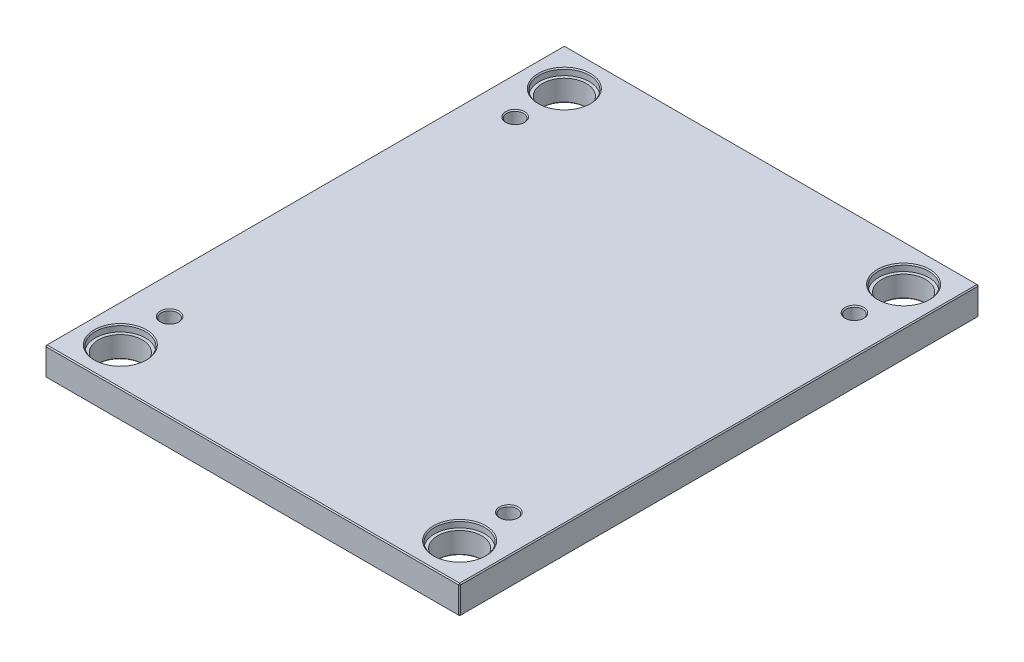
ISO-10303-21;
HEADER;
FILE_DESCRIPTION(('STEP AP214'),'2;1');
FILE_NAME('part.step','',(''),(''),'','','');
FILE_SCHEMA(('AUTOMOTIVE_DESIGN { 1 0 10303 214 1 1 1 1 }'));
ENDSEC;
DATA;
#1=APPLICATION_CONTEXT('core data for automotive mechanical design processes');
#2=APPLICATION_PROTOCOL_DEFINITION('international standard','automotive_design',2000,#1);
#3=PRODUCT_CONTEXT('',#1,'mechanical');
#4=PRODUCT('Part','Part','',(#3));
#5=PRODUCT_RELATED_PRODUCT_CATEGORY('part','',(#4));
#6=PRODUCT_DEFINITION_FORMATION('','',#4);
#7=PRODUCT_DEFINITION_CONTEXT('part definition',#1,'design');
#8=PRODUCT_DEFINITION('design','',#6,#7);
#9=PRODUCT_DEFINITION_SHAPE('','',#8);
#10=(LENGTH_UNIT() NAMED_UNIT(*) SI_UNIT(.MILLI.,.METRE.));
#11=(NAMED_UNIT(*) PLANE_ANGLE_UNIT() SI_UNIT($,.RADIAN.));
#12=(NAMED_UNIT(*) SI_UNIT($,.STERADIAN.) SOLID_ANGLE_UNIT());
#13=UNCERTAINTY_MEASURE_WITH_UNIT(LENGTH_MEASURE(1.E-05),#10,'distance_accuracy_value','');
#14=(GEOMETRIC_REPRESENTATION_CONTEXT(3) GLOBAL_UNCERTAINTY_ASSIGNED_CONTEXT((#13)) GLOBAL_UNIT_ASSIGNED_CONTEXT((#10,
#11,#12)) REPRESENTATION_CONTEXT('',''));
#15=CARTESIAN_POINT('',(0.,0.,0.));
#16=DIRECTION('',(0.,0.,1.));
#17=DIRECTION('',(1.,0.,0.));
#18=AXIS2_PLACEMENT_3D('',#15,#16,#17);
#19=CARTESIAN_POINT('',(-162.,0.,-212.));
#20=DIRECTION('',(0.,1.,0.));
#21=DIRECTION('',(0.,0.,1.));
#22=AXIS2_PLACEMENT_3D('',#19,#20,#21);
#23=CYLINDRICAL_SURFACE('',#22,21.);
#24=CARTESIAN_POINT('',(-162.,0.999999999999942,-212.));
#25=DIRECTION('',(0.,1.,0.));
#26=DIRECTION('',(0.,0.,1.));
#27=AXIS2_PLACEMENT_3D('',#24,#25,#26);
#28=CIRCLE('',#27,21.);
#29=CARTESIAN_POINT('',(-162.,0.999999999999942,-191.));
#30=VERTEX_POINT('',#29);
#31=EDGE_CURVE('E472',#30,#30,#28,.F.);
#32=ORIENTED_EDGE('',*,*,#31,.T.);
#33=EDGE_LOOP('',(#32));
#34=FACE_BOUND('',#33,.T.);
#35=CARTESIAN_POINT('',(-162.,20.7,-212.));
#36=DIRECTION('',(0.,1.,0.));
#37=DIRECTION('',(0.,0.,1.));
#38=AXIS2_PLACEMENT_3D('',#35,#36,#37);
#39=CIRCLE('',#38,21.);
#40=CARTESIAN_POINT('',(-162.,20.7,-191.));
#41=VERTEX_POINT('',#40);
#42=EDGE_CURVE('E221',#41,#41,#39,.F.);
#43=ORIENTED_EDGE('',*,*,#42,.F.);
#44=EDGE_LOOP('',(#43));
#45=FACE_BOUND('',#44,.T.);
#46=ADVANCED_FACE('F16',(#34,#45),#23,.F.);
#47=CARTESIAN_POINT('',(162.,0.,-212.));
#48=DIRECTION('',(0.,1.,0.));
#49=DIRECTION('',(0.,0.,1.));
#50=AXIS2_PLACEMENT_3D('',#47,#48,#49);
#51=CYLINDRICAL_SURFACE('',#50,21.);
#52=CARTESIAN_POINT('',(162.,0.999999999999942,-212.));
#53=DIRECTION('',(0.,1.,0.));
#54=DIRECTION('',(0.,0.,1.));
#55=AXIS2_PLACEMENT_3D('',#52,#53,#54);
#56=CIRCLE('',#55,21.);
#57=CARTESIAN_POINT('',(162.,0.999999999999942,-191.));
#58=VERTEX_POINT('',#57);
#59=EDGE_CURVE('E474',#58,#58,#56,.F.);
#60=ORIENTED_EDGE('',*,*,#59,.T.);
#61=EDGE_LOOP('',(#60));
#62=FACE_BOUND('',#61,.T.);
#63=CARTESIAN_POINT('',(162.,20.7,-212.));
#64=DIRECTION('',(0.,1.,0.));
#65=DIRECTION('',(0.,0.,1.));
#66=AXIS2_PLACEMENT_3D('',#63,#64,#65);
#67=CIRCLE('',#66,21.);
#68=CARTESIAN_POINT('',(162.,20.7,-191.));
#69=VERTEX_POINT('',#68);
#70=EDGE_CURVE('E218',#69,#69,#67,.F.);
#71=ORIENTED_EDGE('',*,*,#70,.F.);
#72=EDGE_LOOP('',(#71));
#73=FACE_BOUND('',#72,.T.);
#74=ADVANCED_FACE('F263',(#62,#73),#51,.F.);
#75=CARTESIAN_POINT('',(162.,0.,212.));
#76=DIRECTION('',(0.,1.,0.));
#77=DIRECTION('',(0.,0.,1.));
#78=AXIS2_PLACEMENT_3D('',#75,#76,#77);
#79=CYLINDRICAL_SURFACE('',#78,21.);
#80=CARTESIAN_POINT('',(162.,1.00000000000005,212.));
#81=DIRECTION('',(0.,1.,0.));
#82=DIRECTION('',(0.,0.,1.));
#83=AXIS2_PLACEMENT_3D('',#80,#81,#82);
#84=CIRCLE('',#83,21.);
#85=CARTESIAN_POINT('',(162.,1.00000000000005,233.));
#86=VERTEX_POINT('',#85);
#87=EDGE_CURVE('E477',#86,#86,#84,.F.);
#88=ORIENTED_EDGE('',*,*,#87,.T.);
#89=EDGE_LOOP('',(#88));
#90=FACE_BOUND('',#89,.T.);
#91=CARTESIAN_POINT('',(162.,20.7,212.));
#92=DIRECTION('',(0.,1.,0.));
#93=DIRECTION('',(0.,0.,1.));
#94=AXIS2_PLACEMENT_3D('',#91,#92,#93);
#95=CIRCLE('',#94,21.);
#96=CARTESIAN_POINT('',(162.,20.7,233.));
#97=VERTEX_POINT('',#96);
#98=EDGE_CURVE('E214',#97,#97,#95,.F.);
#99=ORIENTED_EDGE('',*,*,#98,.F.);
#100=EDGE_LOOP('',(#99));
#101=FACE_BOUND('',#100,.T.);
#102=ADVANCED_FACE('F270',(#90,#101),#79,.F.);
#103=CARTESIAN_POINT('',(-162.,0.,212.));
#104=DIRECTION('',(0.,1.,0.));
#105=DIRECTION('',(0.,0.,1.));
#106=AXIS2_PLACEMENT_3D('',#103,#104,#105);
#107=CYLINDRICAL_SURFACE('',#106,21.);
#108=CARTESIAN_POINT('',(-162.,0.999999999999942,212.));
#109=DIRECTION('',(0.,1.,0.));
#110=DIRECTION('',(0.,0.,1.));
#111=AXIS2_PLACEMENT_3D('',#108,#109,#110);
#112=CIRCLE('',#111,21.);
#113=CARTESIAN_POINT('',(-162.,0.999999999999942,233.));
#114=VERTEX_POINT('',#113);
#115=EDGE_CURVE('E480',#114,#114,#112,.F.);
#116=ORIENTED_EDGE('',*,*,#115,.T.);
#117=EDGE_LOOP('',(#116));
#118=FACE_BOUND('',#117,.T.);
#119=CARTESIAN_POINT('',(-162.,20.7,212.));
#120=DIRECTION('',(0.,1.,0.));
#121=DIRECTION('',(0.,0.,1.));
#122=AXIS2_PLACEMENT_3D('',#119,#120,#121);
#123=CIRCLE('',#122,21.);
#124=CARTESIAN_POINT('',(-162.,20.7,233.));
#125=VERTEX_POINT('',#124);
#126=EDGE_CURVE('E211',#125,#125,#123,.F.);
#127=ORIENTED_EDGE('',*,*,#126,.F.);
#128=EDGE_LOOP('',(#127));
#129=FACE_BOUND('',#128,.T.);
#130=ADVANCED_FACE('F277',(#118,#129),#107,.F.);
#131=CARTESIAN_POINT('',(-198.,27.,248.));
#132=DIRECTION('',(1.,0.,0.));
#133=DIRECTION('',(0.,0.,-1.));
#134=AXIS2_PLACEMENT_3D('',#131,#132,#133);
#135=PLANE('',#134);
#136=DIRECTION('',(0.,-1.,0.));
#137=VECTOR('',#136,1.);
#138=CARTESIAN_POINT('',(-198.,27.,-247.));
#139=LINE('',#138,#137);
#140=CARTESIAN_POINT('',(-198.,26.,-247.));
#141=VERTEX_POINT('',#140);
#142=CARTESIAN_POINT('',(-198.,1.00000000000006,-247.));
#143=VERTEX_POINT('',#142);
#144=EDGE_CURVE('E487',#141,#143,#139,.T.);
#145=ORIENTED_EDGE('',*,*,#144,.T.);
#146=DIRECTION('',(0.,0.,1.));
#147=VECTOR('',#146,1.);
#148=CARTESIAN_POINT('',(-198.,1.00000000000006,248.));
#149=LINE('',#148,#147);
#150=CARTESIAN_POINT('',(-198.,1.00000000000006,247.));
#151=VERTEX_POINT('',#150);
#152=EDGE_CURVE('E490',#143,#151,#149,.T.);
#153=ORIENTED_EDGE('',*,*,#152,.T.);
#154=DIRECTION('',(0.,1.,0.));
#155=VECTOR('',#154,1.);
#156=CARTESIAN_POINT('',(-198.,27.,247.));
#157=LINE('',#156,#155);
#158=CARTESIAN_POINT('',(-198.,26.,247.));
#159=VERTEX_POINT('',#158);
#160=EDGE_CURVE('E485',#151,#159,#157,.T.);
#161=ORIENTED_EDGE('',*,*,#160,.T.);
#162=DIRECTION('',(0.,0.,-1.));
#163=VECTOR('',#162,1.);
#164=CARTESIAN_POINT('',(-198.,26.,-248.));
#165=LINE('',#164,#163);
#166=EDGE_CURVE('E483',#159,#141,#165,.T.);
#167=ORIENTED_EDGE('',*,*,#166,.T.);
#168=EDGE_LOOP('',(#145,#153,#161,#167));
#169=FACE_BOUND('',#168,.T.);
#170=ADVANCED_FACE('F298',(#169),#135,.F.);
#171=CARTESIAN_POINT('',(198.,27.,248.));
#172=DIRECTION('',(0.,0.,-1.));
#173=DIRECTION('',(-1.,0.,0.));
#174=AXIS2_PLACEMENT_3D('',#171,#172,#173);
#175=PLANE('',#174);
#176=DIRECTION('',(-1.,0.,0.));
#177=VECTOR('',#176,1.);
#178=CARTESIAN_POINT('',(-198.,26.,248.));
#179=LINE('',#178,#177);
#180=CARTESIAN_POINT('',(197.,26.,248.));
#181=VERTEX_POINT('',#180);
#182=CARTESIAN_POINT('',(-197.,26.,248.));
#183=VERTEX_POINT('',#182);
#184=EDGE_CURVE('E509',#181,#183,#179,.T.);
#185=ORIENTED_EDGE('',*,*,#184,.T.);
#186=DIRECTION('',(0.,-1.,0.));
#187=VECTOR('',#186,1.);
#188=CARTESIAN_POINT('',(-197.,27.,248.));
#189=LINE('',#188,#187);
#190=CARTESIAN_POINT('',(-197.,1.00000000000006,248.));
#191=VERTEX_POINT('',#190);
#192=EDGE_CURVE('E515',#183,#191,#189,.T.);
#193=ORIENTED_EDGE('',*,*,#192,.T.);
#194=DIRECTION('',(1.,0.,0.));
#195=VECTOR('',#194,1.);
#196=CARTESIAN_POINT('',(198.,1.00000000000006,248.));
#197=LINE('',#196,#195);
#198=CARTESIAN_POINT('',(197.,1.00000000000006,248.));
#199=VERTEX_POINT('',#198);
#200=EDGE_CURVE('E513',#191,#199,#197,.T.);
#201=ORIENTED_EDGE('',*,*,#200,.T.);
#202=DIRECTION('',(0.,1.,0.));
#203=VECTOR('',#202,1.);
#204=CARTESIAN_POINT('',(197.,27.,248.));
#205=LINE('',#204,#203);
#206=EDGE_CURVE('E511',#199,#181,#205,.T.);
#207=ORIENTED_EDGE('',*,*,#206,.T.);
#208=EDGE_LOOP('',(#185,#193,#201,#207));
#209=FACE_BOUND('',#208,.T.);
#210=ADVANCED_FACE('F294',(#209),#175,.F.);
#211=CARTESIAN_POINT('',(198.,27.,248.));
#212=DIRECTION('',(-1.,0.,0.));
#213=DIRECTION('',(0.,0.,1.));
#214=AXIS2_PLACEMENT_3D('',#211,#212,#213);
#215=PLANE('',#214);
#216=DIRECTION('',(0.,0.,-1.));
#217=VECTOR('',#216,1.);
#218=CARTESIAN_POINT('',(198.,1.00000000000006,248.));
#219=LINE('',#218,#217);
#220=CARTESIAN_POINT('',(198.,1.00000000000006,247.));
#221=VERTEX_POINT('',#220);
#222=CARTESIAN_POINT('',(198.,1.00000000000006,-247.));
#223=VERTEX_POINT('',#222);
#224=EDGE_CURVE('E504',#221,#223,#219,.T.);
#225=ORIENTED_EDGE('',*,*,#224,.T.);
#226=DIRECTION('',(0.,1.,0.));
#227=VECTOR('',#226,1.);
#228=CARTESIAN_POINT('',(198.,27.,-247.));
#229=LINE('',#228,#227);
#230=CARTESIAN_POINT('',(198.,26.,-247.));
#231=VERTEX_POINT('',#230);
#232=EDGE_CURVE('E506',#223,#231,#229,.T.);
#233=ORIENTED_EDGE('',*,*,#232,.T.);
#234=DIRECTION('',(0.,0.,1.));
#235=VECTOR('',#234,1.);
#236=CARTESIAN_POINT('',(198.,26.,248.));
#237=LINE('',#236,#235);
#238=CARTESIAN_POINT('',(198.,26.,247.));
#239=VERTEX_POINT('',#238);
#240=EDGE_CURVE('E500',#231,#239,#237,.T.);
#241=ORIENTED_EDGE('',*,*,#240,.T.);
#242=DIRECTION('',(0.,-1.,0.));
#243=VECTOR('',#242,1.);
#244=CARTESIAN_POINT('',(198.,27.,247.));
#245=LINE('',#244,#243);
#246=EDGE_CURVE('E502',#239,#221,#245,.T.);
#247=ORIENTED_EDGE('',*,*,#246,.T.);
#248=EDGE_LOOP('',(#225,#233,#241,#247));
#249=FACE_BOUND('',#248,.T.);
#250=ADVANCED_FACE('F290',(#249),#215,.F.);
#251=CARTESIAN_POINT('',(198.,27.,-248.));
#252=DIRECTION('',(0.,0.,1.));
#253=DIRECTION('',(1.,0.,0.));
#254=AXIS2_PLACEMENT_3D('',#251,#252,#253);
#255=PLANE('',#254);
#256=DIRECTION('',(0.,-1.,0.));
#257=VECTOR('',#256,1.);
#258=CARTESIAN_POINT('',(197.,27.,-248.));
#259=LINE('',#258,#257);
#260=CARTESIAN_POINT('',(197.,26.,-248.));
#261=VERTEX_POINT('',#260);
#262=CARTESIAN_POINT('',(197.,1.00000000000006,-248.));
#263=VERTEX_POINT('',#262);
#264=EDGE_CURVE('E494',#261,#263,#259,.T.);
#265=ORIENTED_EDGE('',*,*,#264,.T.);
#266=DIRECTION('',(-1.,0.,0.));
#267=VECTOR('',#266,1.);
#268=CARTESIAN_POINT('',(198.,1.00000000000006,-248.));
#269=LINE('',#268,#267);
#270=CARTESIAN_POINT('',(-197.,1.00000000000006,-248.));
#271=VERTEX_POINT('',#270);
#272=EDGE_CURVE('E138',#263,#271,#269,.T.);
#273=ORIENTED_EDGE('',*,*,#272,.T.);
#274=DIRECTION('',(0.,1.,0.));
#275=VECTOR('',#274,1.);
#276=CARTESIAN_POINT('',(-197.,27.,-248.));
#277=LINE('',#276,#275);
#278=CARTESIAN_POINT('',(-197.,26.,-248.));
#279=VERTEX_POINT('',#278);
#280=EDGE_CURVE('E496',#271,#279,#277,.T.);
#281=ORIENTED_EDGE('',*,*,#280,.T.);
#282=DIRECTION('',(1.,0.,0.));
#283=VECTOR('',#282,1.);
#284=CARTESIAN_POINT('',(198.,26.,-248.));
#285=LINE('',#284,#283);
#286=EDGE_CURVE('E492',#279,#261,#285,.T.);
#287=ORIENTED_EDGE('',*,*,#286,.T.);
#288=EDGE_LOOP('',(#265,#273,#281,#287));
#289=FACE_BOUND('',#288,.T.);
#290=ADVANCED_FACE('F282',(#289),#255,.F.);
#291=CARTESIAN_POINT('',(0.,27.,0.));
#292=DIRECTION('',(0.,1.,0.));
#293=DIRECTION('',(0.,0.,1.));
#294=AXIS2_PLACEMENT_3D('',#291,#292,#293);
#295=PLANE('',#294);
#296=CARTESIAN_POINT('',(162.,27.,212.));
#297=DIRECTION('',(0.,1.,0.));
#298=DIRECTION('',(0.,0.,1.));
#299=AXIS2_PLACEMENT_3D('',#296,#297,#298);
#300=CIRCLE('',#299,25.);
#301=CARTESIAN_POINT('',(162.,27.,237.));
#302=VERTEX_POINT('',#301);
#303=EDGE_CURVE('E236',#302,#302,#300,.F.);
#304=ORIENTED_EDGE('',*,*,#303,.T.);
#305=EDGE_LOOP('',(#304));
#306=FACE_BOUND('',#305,.T.);
#307=CARTESIAN_POINT('',(-162.,27.,212.));
#308=DIRECTION('',(0.,1.,0.));
#309=DIRECTION('',(0.,0.,1.));
#310=AXIS2_PLACEMENT_3D('',#307,#308,#309);
#311=CIRCLE('',#310,25.);
#312=CARTESIAN_POINT('',(-162.,27.,237.));
#313=VERTEX_POINT('',#312);
#314=EDGE_CURVE('E233',#313,#313,#311,.F.);
#315=ORIENTED_EDGE('',*,*,#314,.T.);
#316=EDGE_LOOP('',(#315));
#317=FACE_BOUND('',#316,.T.);
#318=CARTESIAN_POINT('',(162.,27.,-212.));
#319=DIRECTION('',(0.,1.,0.));
#320=DIRECTION('',(0.,0.,1.));
#321=AXIS2_PLACEMENT_3D('',#318,#319,#320);
#322=CIRCLE('',#321,25.);
#323=CARTESIAN_POINT('',(162.,27.,-187.));
#324=VERTEX_POINT('',#323);
#325=EDGE_CURVE('E230',#324,#324,#322,.F.);
#326=ORIENTED_EDGE('',*,*,#325,.T.);
#327=EDGE_LOOP('',(#326));
#328=FACE_BOUND('',#327,.T.);
#329=CARTESIAN_POINT('',(-162.,27.,-212.));
#330=DIRECTION('',(0.,1.,0.));
#331=DIRECTION('',(0.,0.,1.));
#332=AXIS2_PLACEMENT_3D('',#329,#330,#331);
#333=CIRCLE('',#332,25.);
#334=CARTESIAN_POINT('',(-162.,27.,-187.));
#335=VERTEX_POINT('',#334);
#336=EDGE_CURVE('E227',#335,#335,#333,.F.);
#337=ORIENTED_EDGE('',*,*,#336,.T.);
#338=EDGE_LOOP('',(#337));
#339=FACE_BOUND('',#338,.T.);
#340=CARTESIAN_POINT('',(-162.,27.,165.));
#341=DIRECTION('',(0.,1.,0.));
#342=DIRECTION('',(0.,0.,1.));
#343=AXIS2_PLACEMENT_3D('',#340,#341,#342);
#344=CIRCLE('',#343,9.);
#345=CARTESIAN_POINT('',(-162.,27.,174.));
#346=VERTEX_POINT('',#345);
#347=EDGE_CURVE('E198',#346,#346,#344,.F.);
#348=ORIENTED_EDGE('',*,*,#347,.T.);
#349=EDGE_LOOP('',(#348));
#350=FACE_BOUND('',#349,.T.);
#351=CARTESIAN_POINT('',(162.,27.,165.));
#352=DIRECTION('',(0.,1.,0.));
#353=DIRECTION('',(0.,0.,1.));
#354=AXIS2_PLACEMENT_3D('',#351,#352,#353);
#355=CIRCLE('',#354,9.);
#356=CARTESIAN_POINT('',(162.,27.,174.));
#357=VERTEX_POINT('',#356);
#358=EDGE_CURVE('E195',#357,#357,#355,.F.);
#359=ORIENTED_EDGE('',*,*,#358,.T.);
#360=EDGE_LOOP('',(#359));
#361=FACE_BOUND('',#360,.T.);
#362=CARTESIAN_POINT('',(162.,27.,-165.));
#363=DIRECTION('',(0.,1.,0.));
#364=DIRECTION('',(0.,0.,1.));
#365=AXIS2_PLACEMENT_3D('',#362,#363,#364);
#366=CIRCLE('',#365,9.);
#367=CARTESIAN_POINT('',(162.,27.,-156.));
#368=VERTEX_POINT('',#367);
#369=EDGE_CURVE('E192',#368,#368,#366,.F.);
#370=ORIENTED_EDGE('',*,*,#369,.T.);
#371=EDGE_LOOP('',(#370));
#372=FACE_BOUND('',#371,.T.);
#373=CARTESIAN_POINT('',(-162.,27.,-165.));
#374=DIRECTION('',(0.,1.,0.));
#375=DIRECTION('',(0.,0.,1.));
#376=AXIS2_PLACEMENT_3D('',#373,#374,#375);
#377=CIRCLE('',#376,9.);
#378=CARTESIAN_POINT('',(-162.,27.,-156.));
#379=VERTEX_POINT('',#378);
#380=EDGE_CURVE('E188',#379,#379,#377,.F.);
#381=ORIENTED_EDGE('',*,*,#380,.T.);
#382=EDGE_LOOP('',(#381));
#383=FACE_BOUND('',#382,.T.);
#384=DIRECTION('',(0.,0.,-1.));
#385=VECTOR('',#384,1.);
#386=CARTESIAN_POINT('',(197.,27.,-248.));
#387=LINE('',#386,#385);
#388=CARTESIAN_POINT('',(197.,27.,247.));
#389=VERTEX_POINT('',#388);
#390=CARTESIAN_POINT('',(197.,27.,-247.));
#391=VERTEX_POINT('',#390);
#392=EDGE_CURVE('E31',#389,#391,#387,.T.);
#393=ORIENTED_EDGE('',*,*,#392,.T.);
#394=DIRECTION('',(-1.,0.,0.));
#395=VECTOR('',#394,1.);
#396=CARTESIAN_POINT('',(-198.,27.,-247.));
#397=LINE('',#396,#395);
#398=CARTESIAN_POINT('',(-197.,27.,-247.));
#399=VERTEX_POINT('',#398);
#400=EDGE_CURVE('E189',#391,#399,#397,.T.);
#401=ORIENTED_EDGE('',*,*,#400,.T.);
#402=DIRECTION('',(0.,0.,1.));
#403=VECTOR('',#402,1.);
#404=CARTESIAN_POINT('',(-197.,27.,248.));
#405=LINE('',#404,#403);
#406=CARTESIAN_POINT('',(-197.,27.,247.));
#407=VERTEX_POINT('',#406);
#408=EDGE_CURVE('E518',#399,#407,#405,.T.);
#409=ORIENTED_EDGE('',*,*,#408,.T.);
#410=DIRECTION('',(1.,0.,0.));
#411=VECTOR('',#410,1.);
#412=CARTESIAN_POINT('',(198.,27.,247.));
#413=LINE('',#412,#411);
#414=EDGE_CURVE('E36',#407,#389,#413,.T.);
#415=ORIENTED_EDGE('',*,*,#414,.T.);
#416=EDGE_LOOP('',(#393,#401,#409,#415));
#417=FACE_BOUND('',#416,.T.);
#418=ADVANCED_FACE('F279',(#306,#317,#328,#339,#350,#361,#372,#383,#417),#295,.T.);
#419=CARTESIAN_POINT('',(0.,0.,0.));
#420=DIRECTION('',(0.,1.,0.));
#421=DIRECTION('',(0.,0.,1.));
#422=AXIS2_PLACEMENT_3D('',#419,#420,#421);
#423=PLANE('',#422);
#424=CARTESIAN_POINT('',(-162.,0.,-212.));
#425=DIRECTION('',(0.,1.,0.));
#426=DIRECTION('',(0.,0.,1.));
#427=AXIS2_PLACEMENT_3D('',#424,#425,#426);
#428=CIRCLE('',#427,22.);
#429=CARTESIAN_POINT('',(-162.,0.,-190.));
#430=VERTEX_POINT('',#429);
#431=EDGE_CURVE('E469',#430,#430,#428,.T.);
#432=ORIENTED_EDGE('',*,*,#431,.T.);
#433=EDGE_LOOP('',(#432));
#434=FACE_BOUND('',#433,.T.);
#435=CARTESIAN_POINT('',(162.,0.,-212.));
#436=DIRECTION('',(0.,1.,0.));
#437=DIRECTION('',(0.,0.,1.));
#438=AXIS2_PLACEMENT_3D('',#435,#436,#437);
#439=CIRCLE('',#438,22.);
#440=CARTESIAN_POINT('',(162.,0.,-190.));
#441=VERTEX_POINT('',#440);
#442=EDGE_CURVE('E466',#441,#441,#439,.T.);
#443=ORIENTED_EDGE('',*,*,#442,.T.);
#444=EDGE_LOOP('',(#443));
#445=FACE_BOUND('',#444,.T.);
#446=CARTESIAN_POINT('',(162.,0.,212.));
#447=DIRECTION('',(0.,1.,0.));
#448=DIRECTION('',(0.,0.,1.));
#449=AXIS2_PLACEMENT_3D('',#446,#447,#448);
#450=CIRCLE('',#449,22.);
#451=CARTESIAN_POINT('',(162.,0.,234.));
#452=VERTEX_POINT('',#451);
#453=EDGE_CURVE('E463',#452,#452,#450,.T.);
#454=ORIENTED_EDGE('',*,*,#453,.T.);
#455=EDGE_LOOP('',(#454));
#456=FACE_BOUND('',#455,.T.);
#457=CARTESIAN_POINT('',(-162.,0.,212.));
#458=DIRECTION('',(0.,1.,0.));
#459=DIRECTION('',(0.,0.,1.));
#460=AXIS2_PLACEMENT_3D('',#457,#458,#459);
#461=CIRCLE('',#460,22.);
#462=CARTESIAN_POINT('',(-162.,0.,234.));
#463=VERTEX_POINT('',#462);
#464=EDGE_CURVE('E460',#463,#463,#461,.T.);
#465=ORIENTED_EDGE('',*,*,#464,.T.);
#466=EDGE_LOOP('',(#465));
#467=FACE_BOUND('',#466,.T.);
#468=DIRECTION('',(0.,0.,1.));
#469=VECTOR('',#468,1.);
#470=CARTESIAN_POINT('',(197.,0.,0.));
#471=LINE('',#470,#469);
#472=CARTESIAN_POINT('',(197.,0.,-247.));
#473=VERTEX_POINT('',#472);
#474=CARTESIAN_POINT('',(197.,0.,247.));
#475=VERTEX_POINT('',#474);
#476=EDGE_CURVE('E108',#473,#475,#471,.T.);
#477=ORIENTED_EDGE('',*,*,#476,.T.);
#478=DIRECTION('',(-1.,0.,0.));
#479=VECTOR('',#478,1.);
#480=CARTESIAN_POINT('',(0.,0.,247.));
#481=LINE('',#480,#479);
#482=CARTESIAN_POINT('',(-197.,0.,247.));
#483=VERTEX_POINT('',#482);
#484=EDGE_CURVE('E458',#475,#483,#481,.T.);
#485=ORIENTED_EDGE('',*,*,#484,.T.);
#486=DIRECTION('',(0.,0.,-1.));
#487=VECTOR('',#486,1.);
#488=CARTESIAN_POINT('',(-197.,0.,0.));
#489=LINE('',#488,#487);
#490=CARTESIAN_POINT('',(-197.,0.,-247.));
#491=VERTEX_POINT('',#490);
#492=EDGE_CURVE('E110',#483,#491,#489,.T.);
#493=ORIENTED_EDGE('',*,*,#492,.T.);
#494=DIRECTION('',(1.,0.,0.));
#495=VECTOR('',#494,1.);
#496=CARTESIAN_POINT('',(0.,0.,-247.));
#497=LINE('',#496,#495);
#498=EDGE_CURVE('E104',#491,#473,#497,.T.);
#499=ORIENTED_EDGE('',*,*,#498,.T.);
#500=EDGE_LOOP('',(#477,#485,#493,#499));
#501=FACE_BOUND('',#500,.T.);
#502=ADVANCED_FACE('F106',(#434,#445,#456,#467,#501),#423,.F.);
#503=CARTESIAN_POINT('',(-162.,0.,-212.));
#504=DIRECTION('',(0.,-1.,0.));
#505=DIRECTION('',(0.,0.,-1.));
#506=AXIS2_PLACEMENT_3D('',#503,#504,#505);
#507=CONICAL_SURFACE('',#506,22.,0.785398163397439);
#508=ORIENTED_EDGE('',*,*,#31,.F.);
#509=EDGE_LOOP('',(#508));
#510=FACE_BOUND('',#509,.T.);
#511=ORIENTED_EDGE('',*,*,#431,.F.);
#512=EDGE_LOOP('',(#511));
#513=FACE_BOUND('',#512,.T.);
#514=ADVANCED_FACE('F286',(#510,#513),#507,.F.);
#515=CARTESIAN_POINT('',(162.,0.,-212.));
#516=DIRECTION('',(0.,-1.,0.));
#517=DIRECTION('',(0.,0.,-1.));
#518=AXIS2_PLACEMENT_3D('',#515,#516,#517);
#519=CONICAL_SURFACE('',#518,22.,0.785398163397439);
#520=ORIENTED_EDGE('',*,*,#59,.F.);
#521=EDGE_LOOP('',(#520));
#522=FACE_BOUND('',#521,.T.);
#523=ORIENTED_EDGE('',*,*,#442,.F.);
#524=EDGE_LOOP('',(#523));
#525=FACE_BOUND('',#524,.T.);
#526=ADVANCED_FACE('F305',(#522,#525),#519,.F.);
#527=CARTESIAN_POINT('',(162.,0.,212.));
#528=DIRECTION('',(0.,-1.,0.));
#529=DIRECTION('',(0.,0.,-1.));
#530=AXIS2_PLACEMENT_3D('',#527,#528,#529);
#531=CONICAL_SURFACE('',#530,22.,0.785398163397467);
#532=ORIENTED_EDGE('',*,*,#87,.F.);
#533=EDGE_LOOP('',(#532));
#534=FACE_BOUND('',#533,.T.);
#535=ORIENTED_EDGE('',*,*,#453,.F.);
#536=EDGE_LOOP('',(#535));
#537=FACE_BOUND('',#536,.T.);
#538=ADVANCED_FACE('F309',(#534,#537),#531,.F.);
#539=CARTESIAN_POINT('',(-162.,0.,212.));
#540=DIRECTION('',(0.,-1.,0.));
#541=DIRECTION('',(0.,0.,-1.));
#542=AXIS2_PLACEMENT_3D('',#539,#540,#541);
#543=CONICAL_SURFACE('',#542,22.,0.785398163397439);
#544=ORIENTED_EDGE('',*,*,#115,.F.);
#545=EDGE_LOOP('',(#544));
#546=FACE_BOUND('',#545,.T.);
#547=ORIENTED_EDGE('',*,*,#464,.F.);
#548=EDGE_LOOP('',(#547));
#549=FACE_BOUND('',#548,.T.);
#550=ADVANCED_FACE('F313',(#546,#549),#543,.F.);
#551=CARTESIAN_POINT('',(198.,27.,247.));
#552=DIRECTION('',(-0.707106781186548,0.,-0.707106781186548));
#553=DIRECTION('',(0.,-1.,0.));
#554=AXIS2_PLACEMENT_3D('',#551,#552,#553);
#555=PLANE('',#554);
#556=DIRECTION('',(-0.707106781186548,0.,0.707106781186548));
#557=VECTOR('',#556,1.);
#558=CARTESIAN_POINT('',(197.,26.,248.));
#559=LINE('',#558,#557);
#560=EDGE_CURVE('E126',#181,#239,#559,.F.);
#561=ORIENTED_EDGE('',*,*,#560,.F.);
#562=ORIENTED_EDGE('',*,*,#206,.F.);
#563=DIRECTION('',(0.707106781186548,0.,-0.707106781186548));
#564=VECTOR('',#563,1.);
#565=CARTESIAN_POINT('',(197.,1.00000000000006,248.));
#566=LINE('',#565,#564);
#567=EDGE_CURVE('E180',#221,#199,#566,.F.);
#568=ORIENTED_EDGE('',*,*,#567,.F.);
#569=ORIENTED_EDGE('',*,*,#246,.F.);
#570=EDGE_LOOP('',(#561,#562,#568,#569));
#571=FACE_BOUND('',#570,.T.);
#572=ADVANCED_FACE('F317',(#571),#555,.F.);
#573=CARTESIAN_POINT('',(197.,26.,248.));
#574=DIRECTION('',(0.577350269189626,0.577350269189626,0.577350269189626));
#575=DIRECTION('',(0.707106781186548,0.,-0.707106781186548));
#576=AXIS2_PLACEMENT_3D('',#573,#574,#575);
#577=PLANE('',#576);
#578=DIRECTION('',(0.,-0.707106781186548,0.707106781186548));
#579=VECTOR('',#578,1.);
#580=CARTESIAN_POINT('',(197.,26.,248.));
#581=LINE('',#580,#579);
#582=EDGE_CURVE('E175',#181,#389,#581,.F.);
#583=ORIENTED_EDGE('',*,*,#582,.F.);
#584=ORIENTED_EDGE('',*,*,#560,.T.);
#585=DIRECTION('',(-0.707106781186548,0.707106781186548,0.));
#586=VECTOR('',#585,1.);
#587=CARTESIAN_POINT('',(197.5,26.5,247.));
#588=LINE('',#587,#586);
#589=EDGE_CURVE('E177',#389,#239,#588,.F.);
#590=ORIENTED_EDGE('',*,*,#589,.F.);
#591=EDGE_LOOP('',(#583,#584,#590));
#592=FACE_BOUND('',#591,.T.);
#593=ADVANCED_FACE('F385',(#592),#577,.T.);
#594=CARTESIAN_POINT('',(197.,1.00000000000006,248.));
#595=DIRECTION('',(0.577350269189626,-0.577350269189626,0.577350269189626));
#596=DIRECTION('',(0.707106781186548,0.,-0.707106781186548));
#597=AXIS2_PLACEMENT_3D('',#594,#595,#596);
#598=PLANE('',#597);
#599=DIRECTION('',(-0.707106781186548,-0.707106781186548,0.));
#600=VECTOR('',#599,1.);
#601=CARTESIAN_POINT('',(197.5,0.500000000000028,247.));
#602=LINE('',#601,#600);
#603=EDGE_CURVE('E124',#221,#475,#602,.T.);
#604=ORIENTED_EDGE('',*,*,#603,.F.);
#605=ORIENTED_EDGE('',*,*,#567,.T.);
#606=DIRECTION('',(0.,0.707106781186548,0.707106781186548));
#607=VECTOR('',#606,1.);
#608=CARTESIAN_POINT('',(197.,1.00000000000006,248.));
#609=LINE('',#608,#607);
#610=EDGE_CURVE('E172',#475,#199,#609,.T.);
#611=ORIENTED_EDGE('',*,*,#610,.F.);
#612=EDGE_LOOP('',(#604,#605,#611));
#613=FACE_BOUND('',#612,.T.);
#614=ADVANCED_FACE('F381',(#613),#598,.T.);
#615=CARTESIAN_POINT('',(197.,27.,0.));
#616=DIRECTION('',(0.707106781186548,0.707106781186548,0.));
#617=DIRECTION('',(0.,0.,1.));
#618=AXIS2_PLACEMENT_3D('',#615,#616,#617);
#619=PLANE('',#618);
#620=ORIENTED_EDGE('',*,*,#589,.T.);
#621=ORIENTED_EDGE('',*,*,#240,.F.);
#622=DIRECTION('',(0.707106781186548,-0.707106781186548,0.));
#623=VECTOR('',#622,1.);
#624=CARTESIAN_POINT('',(198.,26.,-247.));
#625=LINE('',#624,#623);
#626=EDGE_CURVE('E166',#391,#231,#625,.T.);
#627=ORIENTED_EDGE('',*,*,#626,.F.);
#628=ORIENTED_EDGE('',*,*,#392,.F.);
#629=EDGE_LOOP('',(#620,#621,#627,#628));
#630=FACE_BOUND('',#629,.T.);
#631=ADVANCED_FACE('F377',(#630),#619,.T.);
#632=CARTESIAN_POINT('',(0.,27.,247.));
#633=DIRECTION('',(0.,0.707106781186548,0.707106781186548));
#634=DIRECTION('',(-1.,0.,0.));
#635=AXIS2_PLACEMENT_3D('',#632,#633,#634);
#636=PLANE('',#635);
#637=ORIENTED_EDGE('',*,*,#582,.T.);
#638=ORIENTED_EDGE('',*,*,#414,.F.);
#639=DIRECTION('',(0.,0.707106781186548,-0.707106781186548));
#640=VECTOR('',#639,1.);
#641=CARTESIAN_POINT('',(-197.,26.5,247.5));
#642=LINE('',#641,#640);
#643=EDGE_CURVE('E163',#183,#407,#642,.T.);
#644=ORIENTED_EDGE('',*,*,#643,.F.);
#645=ORIENTED_EDGE('',*,*,#184,.F.);
#646=EDGE_LOOP('',(#637,#638,#644,#645));
#647=FACE_BOUND('',#646,.T.);
#648=ADVANCED_FACE('F373',(#647),#636,.T.);
#649=CARTESIAN_POINT('',(-197.,27.,248.));
#650=DIRECTION('',(0.707106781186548,0.,-0.707106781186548));
#651=DIRECTION('',(0.,-1.,0.));
#652=AXIS2_PLACEMENT_3D('',#649,#650,#651);
#653=PLANE('',#652);
#654=DIRECTION('',(0.707106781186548,0.,0.707106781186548));
#655=VECTOR('',#654,1.);
#656=CARTESIAN_POINT('',(-197.,1.00000000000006,248.));
#657=LINE('',#656,#655);
#658=EDGE_CURVE('E157',#191,#151,#657,.F.);
#659=ORIENTED_EDGE('',*,*,#658,.F.);
#660=ORIENTED_EDGE('',*,*,#192,.F.);
#661=DIRECTION('',(-0.707106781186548,0.,-0.707106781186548));
#662=VECTOR('',#661,1.);
#663=CARTESIAN_POINT('',(-198.,26.,247.));
#664=LINE('',#663,#662);
#665=EDGE_CURVE('E160',#159,#183,#664,.F.);
#666=ORIENTED_EDGE('',*,*,#665,.F.);
#667=ORIENTED_EDGE('',*,*,#160,.F.);
#668=EDGE_LOOP('',(#659,#660,#666,#667));
#669=FACE_BOUND('',#668,.T.);
#670=ADVANCED_FACE('F369',(#669),#653,.F.);
#671=CARTESIAN_POINT('',(198.,1.00000000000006,248.));
#672=DIRECTION('',(0.,0.707106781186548,-0.707106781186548));
#673=DIRECTION('',(1.,0.,0.));
#674=AXIS2_PLACEMENT_3D('',#671,#672,#673);
#675=PLANE('',#674);
#676=ORIENTED_EDGE('',*,*,#610,.T.);
#677=ORIENTED_EDGE('',*,*,#200,.F.);
#678=DIRECTION('',(0.,-0.707106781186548,-0.707106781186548));
#679=VECTOR('',#678,1.);
#680=CARTESIAN_POINT('',(-197.,1.00000000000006,248.));
#681=LINE('',#680,#679);
#682=EDGE_CURVE('E135',#483,#191,#681,.F.);
#683=ORIENTED_EDGE('',*,*,#682,.F.);
#684=ORIENTED_EDGE('',*,*,#484,.F.);
#685=EDGE_LOOP('',(#676,#677,#683,#684));
#686=FACE_BOUND('',#685,.T.);
#687=ADVANCED_FACE('F366',(#686),#675,.F.);
#688=CARTESIAN_POINT('',(198.,1.00000000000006,248.));
#689=DIRECTION('',(-0.707106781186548,0.707106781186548,0.));
#690=DIRECTION('',(0.,0.,-1.));
#691=AXIS2_PLACEMENT_3D('',#688,#689,#690);
#692=PLANE('',#691);
#693=ORIENTED_EDGE('',*,*,#603,.T.);
#694=ORIENTED_EDGE('',*,*,#476,.F.);
#695=DIRECTION('',(0.707106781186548,0.707106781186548,0.));
#696=VECTOR('',#695,1.);
#697=CARTESIAN_POINT('',(197.5,0.500000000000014,-247.));
#698=LINE('',#697,#696);
#699=EDGE_CURVE('E121',#223,#473,#698,.F.);
#700=ORIENTED_EDGE('',*,*,#699,.F.);
#701=ORIENTED_EDGE('',*,*,#224,.F.);
#702=EDGE_LOOP('',(#693,#694,#700,#701));
#703=FACE_BOUND('',#702,.T.);
#704=ADVANCED_FACE('F119',(#703),#692,.F.);
#705=CARTESIAN_POINT('',(197.,27.,-248.));
#706=DIRECTION('',(-0.707106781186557,0.,0.707106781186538));
#707=DIRECTION('',(0.,-1.,0.));
#708=AXIS2_PLACEMENT_3D('',#705,#706,#707);
#709=PLANE('',#708);
#710=DIRECTION('',(0.707106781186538,0.,0.707106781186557));
#711=VECTOR('',#710,1.);
#712=CARTESIAN_POINT('',(198.,26.,-247.));
#713=LINE('',#712,#711);
#714=EDGE_CURVE('E168',#231,#261,#713,.F.);
#715=ORIENTED_EDGE('',*,*,#714,.F.);
#716=ORIENTED_EDGE('',*,*,#232,.F.);
#717=DIRECTION('',(-0.707106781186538,0.,-0.707106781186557));
#718=VECTOR('',#717,1.);
#719=CARTESIAN_POINT('',(197.,1.00000000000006,-248.));
#720=LINE('',#719,#718);
#721=EDGE_CURVE('E134',#263,#223,#720,.F.);
#722=ORIENTED_EDGE('',*,*,#721,.F.);
#723=ORIENTED_EDGE('',*,*,#264,.F.);
#724=EDGE_LOOP('',(#715,#716,#722,#723));
#725=FACE_BOUND('',#724,.T.);
#726=ADVANCED_FACE('F359',(#725),#709,.F.);
#727=CARTESIAN_POINT('',(198.,26.,-247.));
#728=DIRECTION('',(0.577350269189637,0.57735026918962,-0.57735026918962));
#729=DIRECTION('',(-0.707106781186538,0.,-0.707106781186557));
#730=AXIS2_PLACEMENT_3D('',#727,#728,#729);
#731=PLANE('',#730);
#732=ORIENTED_EDGE('',*,*,#626,.T.);
#733=ORIENTED_EDGE('',*,*,#714,.T.);
#734=DIRECTION('',(0.,0.707106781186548,0.707106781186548));
#735=VECTOR('',#734,1.);
#736=CARTESIAN_POINT('',(197.,26.5,-247.5));
#737=LINE('',#736,#735);
#738=EDGE_CURVE('E152',#391,#261,#737,.F.);
#739=ORIENTED_EDGE('',*,*,#738,.F.);
#740=EDGE_LOOP('',(#732,#733,#739));
#741=FACE_BOUND('',#740,.T.);
#742=ADVANCED_FACE('F355',(#741),#731,.T.);
#743=CARTESIAN_POINT('',(-198.,26.,247.));
#744=DIRECTION('',(-0.577350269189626,0.577350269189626,0.577350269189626));
#745=DIRECTION('',(0.707106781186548,0.,0.707106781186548));
#746=AXIS2_PLACEMENT_3D('',#743,#744,#745);
#747=PLANE('',#746);
#748=ORIENTED_EDGE('',*,*,#665,.T.);
#749=ORIENTED_EDGE('',*,*,#643,.T.);
#750=DIRECTION('',(-0.707106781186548,-0.707106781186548,0.));
#751=VECTOR('',#750,1.);
#752=CARTESIAN_POINT('',(-198.,26.,247.));
#753=LINE('',#752,#751);
#754=EDGE_CURVE('E143',#159,#407,#753,.F.);
#755=ORIENTED_EDGE('',*,*,#754,.F.);
#756=EDGE_LOOP('',(#748,#749,#755));
#757=FACE_BOUND('',#756,.T.);
#758=ADVANCED_FACE('F351',(#757),#747,.T.);
#759=CARTESIAN_POINT('',(-197.,1.00000000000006,248.));
#760=DIRECTION('',(-0.577350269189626,-0.577350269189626,0.577350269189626));
#761=DIRECTION('',(0.707106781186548,0.,0.707106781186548));
#762=AXIS2_PLACEMENT_3D('',#759,#760,#761);
#763=PLANE('',#762);
#764=ORIENTED_EDGE('',*,*,#682,.T.);
#765=ORIENTED_EDGE('',*,*,#658,.T.);
#766=DIRECTION('',(-0.707106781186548,0.707106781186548,0.));
#767=VECTOR('',#766,1.);
#768=CARTESIAN_POINT('',(-197.5,0.500000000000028,247.));
#769=LINE('',#768,#767);
#770=EDGE_CURVE('E139',#483,#151,#769,.T.);
#771=ORIENTED_EDGE('',*,*,#770,.F.);
#772=EDGE_LOOP('',(#764,#765,#771));
#773=FACE_BOUND('',#772,.T.);
#774=ADVANCED_FACE('F348',(#773),#763,.T.);
#775=CARTESIAN_POINT('',(197.,1.00000000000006,-248.));
#776=DIRECTION('',(0.577350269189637,-0.57735026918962,-0.57735026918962));
#777=DIRECTION('',(-0.707106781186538,0.,-0.707106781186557));
#778=AXIS2_PLACEMENT_3D('',#775,#776,#777);
#779=PLANE('',#778);
#780=ORIENTED_EDGE('',*,*,#721,.T.);
#781=ORIENTED_EDGE('',*,*,#699,.T.);
#782=DIRECTION('',(0.,-0.707106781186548,0.707106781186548));
#783=VECTOR('',#782,1.);
#784=CARTESIAN_POINT('',(197.,1.00000000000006,-248.));
#785=LINE('',#784,#783);
#786=EDGE_CURVE('E131',#263,#473,#785,.T.);
#787=ORIENTED_EDGE('',*,*,#786,.F.);
#788=EDGE_LOOP('',(#780,#781,#787));
#789=FACE_BOUND('',#788,.T.);
#790=ADVANCED_FACE('F130',(#789),#779,.T.);
#791=CARTESIAN_POINT('',(0.,27.,-247.));
#792=DIRECTION('',(0.,0.707106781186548,-0.707106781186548));
#793=DIRECTION('',(1.,0.,0.));
#794=AXIS2_PLACEMENT_3D('',#791,#792,#793);
#795=PLANE('',#794);
#796=ORIENTED_EDGE('',*,*,#738,.T.);
#797=ORIENTED_EDGE('',*,*,#286,.F.);
#798=DIRECTION('',(0.,-0.707106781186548,-0.707106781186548));
#799=VECTOR('',#798,1.);
#800=CARTESIAN_POINT('',(-197.,26.,-248.));
#801=LINE('',#800,#799);
#802=EDGE_CURVE('E140',#399,#279,#801,.T.);
#803=ORIENTED_EDGE('',*,*,#802,.F.);
#804=ORIENTED_EDGE('',*,*,#400,.F.);
#805=EDGE_LOOP('',(#796,#797,#803,#804));
#806=FACE_BOUND('',#805,.T.);
#807=ADVANCED_FACE('F341',(#806),#795,.T.);
#808=CARTESIAN_POINT('',(-197.,27.,0.));
#809=DIRECTION('',(-0.707106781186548,0.707106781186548,0.));
#810=DIRECTION('',(0.,0.,-1.));
#811=AXIS2_PLACEMENT_3D('',#808,#809,#810);
#812=PLANE('',#811);
#813=ORIENTED_EDGE('',*,*,#754,.T.);
#814=ORIENTED_EDGE('',*,*,#408,.F.);
#815=DIRECTION('',(0.707106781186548,0.707106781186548,0.));
#816=VECTOR('',#815,1.);
#817=CARTESIAN_POINT('',(-197.5,26.5,-247.));
#818=LINE('',#817,#816);
#819=EDGE_CURVE('E146',#141,#399,#818,.T.);
#820=ORIENTED_EDGE('',*,*,#819,.F.);
#821=ORIENTED_EDGE('',*,*,#166,.F.);
#822=EDGE_LOOP('',(#813,#814,#820,#821));
#823=FACE_BOUND('',#822,.T.);
#824=ADVANCED_FACE('F337',(#823),#812,.T.);
#825=CARTESIAN_POINT('',(-198.,1.00000000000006,248.));
#826=DIRECTION('',(0.707106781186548,0.707106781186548,0.));
#827=DIRECTION('',(0.,0.,1.));
#828=AXIS2_PLACEMENT_3D('',#825,#826,#827);
#829=PLANE('',#828);
#830=ORIENTED_EDGE('',*,*,#770,.T.);
#831=ORIENTED_EDGE('',*,*,#152,.F.);
#832=DIRECTION('',(0.707106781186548,-0.707106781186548,0.));
#833=VECTOR('',#832,1.);
#834=CARTESIAN_POINT('',(-198.,1.00000000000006,-247.));
#835=LINE('',#834,#833);
#836=EDGE_CURVE('E529',#491,#143,#835,.F.);
#837=ORIENTED_EDGE('',*,*,#836,.F.);
#838=ORIENTED_EDGE('',*,*,#492,.F.);
#839=EDGE_LOOP('',(#830,#831,#837,#838));
#840=FACE_BOUND('',#839,.T.);
#841=ADVANCED_FACE('F334',(#840),#829,.F.);
#842=CARTESIAN_POINT('',(198.,1.00000000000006,-248.));
#843=DIRECTION('',(0.,0.707106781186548,0.707106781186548));
#844=DIRECTION('',(-1.,0.,0.));
#845=AXIS2_PLACEMENT_3D('',#842,#843,#844);
#846=PLANE('',#845);
#847=ORIENTED_EDGE('',*,*,#786,.T.);
#848=ORIENTED_EDGE('',*,*,#498,.F.);
#849=DIRECTION('',(0.,0.707106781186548,-0.707106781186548));
#850=VECTOR('',#849,1.);
#851=CARTESIAN_POINT('',(-197.,0.500000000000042,-247.5));
#852=LINE('',#851,#850);
#853=EDGE_CURVE('E526',#271,#491,#852,.F.);
#854=ORIENTED_EDGE('',*,*,#853,.F.);
#855=ORIENTED_EDGE('',*,*,#272,.F.);
#856=EDGE_LOOP('',(#847,#848,#854,#855));
#857=FACE_BOUND('',#856,.T.);
#858=ADVANCED_FACE('F137',(#857),#846,.F.);
#859=CARTESIAN_POINT('',(-197.,26.,-248.));
#860=DIRECTION('',(-0.577350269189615,0.577350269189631,-0.577350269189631));
#861=DIRECTION('',(0.,0.707106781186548,0.707106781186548));
#862=AXIS2_PLACEMENT_3D('',#859,#860,#861);
#863=PLANE('',#862);
#864=ORIENTED_EDGE('',*,*,#819,.T.);
#865=ORIENTED_EDGE('',*,*,#802,.T.);
#866=DIRECTION('',(0.707106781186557,0.,-0.707106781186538));
#867=VECTOR('',#866,1.);
#868=CARTESIAN_POINT('',(-197.,26.,-248.));
#869=LINE('',#868,#867);
#870=EDGE_CURVE('E524',#141,#279,#869,.T.);
#871=ORIENTED_EDGE('',*,*,#870,.F.);
#872=EDGE_LOOP('',(#864,#865,#871));
#873=FACE_BOUND('',#872,.T.);
#874=ADVANCED_FACE('F327',(#873),#863,.T.);
#875=CARTESIAN_POINT('',(-198.,1.00000000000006,-247.));
#876=DIRECTION('',(-0.577350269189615,-0.577350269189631,-0.577350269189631));
#877=DIRECTION('',(0.,0.707106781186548,-0.707106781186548));
#878=AXIS2_PLACEMENT_3D('',#875,#876,#877);
#879=PLANE('',#878);
#880=ORIENTED_EDGE('',*,*,#853,.T.);
#881=ORIENTED_EDGE('',*,*,#836,.T.);
#882=DIRECTION('',(-0.707106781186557,0.,0.707106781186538));
#883=VECTOR('',#882,1.);
#884=CARTESIAN_POINT('',(-198.,1.00000000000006,-247.));
#885=LINE('',#884,#883);
#886=EDGE_CURVE('E455',#271,#143,#885,.T.);
#887=ORIENTED_EDGE('',*,*,#886,.F.);
#888=EDGE_LOOP('',(#880,#881,#887));
#889=FACE_BOUND('',#888,.T.);
#890=ADVANCED_FACE('F323',(#889),#879,.T.);
#891=CARTESIAN_POINT('',(-198.,27.,-247.));
#892=DIRECTION('',(0.707106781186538,0.,0.707106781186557));
#893=DIRECTION('',(0.,-1.,0.));
#894=AXIS2_PLACEMENT_3D('',#891,#892,#893);
#895=PLANE('',#894);
#896=ORIENTED_EDGE('',*,*,#870,.T.);
#897=ORIENTED_EDGE('',*,*,#280,.F.);
#898=ORIENTED_EDGE('',*,*,#886,.T.);
#899=ORIENTED_EDGE('',*,*,#144,.F.);
#900=EDGE_LOOP('',(#896,#897,#898,#899));
#901=FACE_BOUND('',#900,.T.);
#902=ADVANCED_FACE('F319',(#901),#895,.F.);
#903=CARTESIAN_POINT('',(-162.,5.,-165.));
#904=DIRECTION('',(0.,1.,0.));
#905=DIRECTION('',(0.,0.,1.));
#906=AXIS2_PLACEMENT_3D('',#903,#904,#905);
#907=CYLINDRICAL_SURFACE('',#906,8.);
#908=CARTESIAN_POINT('',(-162.,26.,-165.));
#909=DIRECTION('',(0.,1.,0.));
#910=DIRECTION('',(0.,0.,1.));
#911=AXIS2_PLACEMENT_3D('',#908,#909,#910);
#912=CIRCLE('',#911,8.);
#913=CARTESIAN_POINT('',(-162.,26.,-157.));
#914=VERTEX_POINT('',#913);
#915=EDGE_CURVE('E207',#914,#914,#912,.T.);
#916=ORIENTED_EDGE('',*,*,#915,.T.);
#917=EDGE_LOOP('',(#916));
#918=FACE_BOUND('',#917,.T.);
#919=CARTESIAN_POINT('',(-162.,5.,-165.));
#920=DIRECTION('',(0.,1.,0.));
#921=DIRECTION('',(0.,0.,1.));
#922=AXIS2_PLACEMENT_3D('',#919,#920,#921);
#923=CIRCLE('',#922,8.);
#924=CARTESIAN_POINT('',(-162.,5.,-157.));
#925=VERTEX_POINT('',#924);
#926=EDGE_CURVE('E448',#925,#925,#923,.T.);
#927=ORIENTED_EDGE('',*,*,#926,.F.);
#928=EDGE_LOOP('',(#927));
#929=FACE_BOUND('',#928,.T.);
#930=ADVANCED_FACE('F322',(#918,#929),#907,.F.);
#931=CARTESIAN_POINT('',(-162.,5.,-165.));
#932=DIRECTION('',(0.,1.,0.));
#933=DIRECTION('',(0.,0.,1.));
#934=AXIS2_PLACEMENT_3D('',#931,#932,#933);
#935=PLANE('',#934);
#936=ORIENTED_EDGE('',*,*,#926,.T.);
#937=EDGE_LOOP('',(#936));
#938=FACE_BOUND('',#937,.T.);
#939=ADVANCED_FACE('F596',(#938),#935,.T.);
#940=CARTESIAN_POINT('',(162.,5.,-165.));
#941=DIRECTION('',(0.,1.,0.));
#942=DIRECTION('',(0.,0.,1.));
#943=AXIS2_PLACEMENT_3D('',#940,#941,#942);
#944=CYLINDRICAL_SURFACE('',#943,8.);
#945=CARTESIAN_POINT('',(162.,26.,-165.));
#946=DIRECTION('',(0.,1.,0.));
#947=DIRECTION('',(0.,0.,1.));
#948=AXIS2_PLACEMENT_3D('',#945,#946,#947);
#949=CIRCLE('',#948,8.);
#950=CARTESIAN_POINT('',(162.,26.,-157.));
#951=VERTEX_POINT('',#950);
#952=EDGE_CURVE('E204',#951,#951,#949,.T.);
#953=ORIENTED_EDGE('',*,*,#952,.T.);
#954=EDGE_LOOP('',(#953));
#955=FACE_BOUND('',#954,.T.);
#956=CARTESIAN_POINT('',(162.,5.,-165.));
#957=DIRECTION('',(0.,1.,0.));
#958=DIRECTION('',(0.,0.,1.));
#959=AXIS2_PLACEMENT_3D('',#956,#957,#958);
#960=CIRCLE('',#959,8.);
#961=CARTESIAN_POINT('',(162.,5.,-157.));
#962=VERTEX_POINT('',#961);
#963=EDGE_CURVE('E445',#962,#962,#960,.T.);
#964=ORIENTED_EDGE('',*,*,#963,.F.);
#965=EDGE_LOOP('',(#964));
#966=FACE_BOUND('',#965,.T.);
#967=ADVANCED_FACE('F592',(#955,#966),#944,.F.);
#968=CARTESIAN_POINT('',(162.,5.,-165.));
#969=DIRECTION('',(0.,1.,0.));
#970=DIRECTION('',(0.,0.,1.));
#971=AXIS2_PLACEMENT_3D('',#968,#969,#970);
#972=PLANE('',#971);
#973=ORIENTED_EDGE('',*,*,#963,.T.);
#974=EDGE_LOOP('',(#973));
#975=FACE_BOUND('',#974,.T.);
#976=ADVANCED_FACE('F588',(#975),#972,.T.);
#977=CARTESIAN_POINT('',(162.,5.,165.));
#978=DIRECTION('',(0.,1.,0.));
#979=DIRECTION('',(0.,0.,1.));
#980=AXIS2_PLACEMENT_3D('',#977,#978,#979);
#981=CYLINDRICAL_SURFACE('',#980,8.);
#982=CARTESIAN_POINT('',(162.,26.,165.));
#983=DIRECTION('',(0.,1.,0.));
#984=DIRECTION('',(0.,0.,1.));
#985=AXIS2_PLACEMENT_3D('',#982,#983,#984);
#986=CIRCLE('',#985,8.);
#987=CARTESIAN_POINT('',(162.,26.,173.));
#988=VERTEX_POINT('',#987);
#989=EDGE_CURVE('E201',#988,#988,#986,.T.);
#990=ORIENTED_EDGE('',*,*,#989,.T.);
#991=EDGE_LOOP('',(#990));
#992=FACE_BOUND('',#991,.T.);
#993=CARTESIAN_POINT('',(162.,5.,165.));
#994=DIRECTION('',(0.,1.,0.));
#995=DIRECTION('',(0.,0.,1.));
#996=AXIS2_PLACEMENT_3D('',#993,#994,#995);
#997=CIRCLE('',#996,8.);
#998=CARTESIAN_POINT('',(162.,5.,173.));
#999=VERTEX_POINT('',#998);
#1000=EDGE_CURVE('E449',#999,#999,#997,.T.);
#1001=ORIENTED_EDGE('',*,*,#1000,.F.);
#1002=EDGE_LOOP('',(#1001));
#1003=FACE_BOUND('',#1002,.T.);
#1004=ADVANCED_FACE('F591',(#992,#1003),#981,.F.);
#1005=CARTESIAN_POINT('',(162.,5.,165.));
#1006=DIRECTION('',(0.,1.,0.));
#1007=DIRECTION('',(0.,0.,1.));
#1008=AXIS2_PLACEMENT_3D('',#1005,#1006,#1007);
#1009=PLANE('',#1008);
#1010=ORIENTED_EDGE('',*,*,#1000,.T.);
#1011=EDGE_LOOP('',(#1010));
#1012=FACE_BOUND('',#1011,.T.);
#1013=ADVANCED_FACE('F598',(#1012),#1009,.T.);
#1014=CARTESIAN_POINT('',(-162.,5.,165.));
#1015=DIRECTION('',(0.,1.,0.));
#1016=DIRECTION('',(0.,0.,1.));
#1017=AXIS2_PLACEMENT_3D('',#1014,#1015,#1016);
#1018=CYLINDRICAL_SURFACE('',#1017,8.);
#1019=CARTESIAN_POINT('',(-162.,26.,165.));
#1020=DIRECTION('',(0.,1.,0.));
#1021=DIRECTION('',(0.,0.,1.));
#1022=AXIS2_PLACEMENT_3D('',#1019,#1020,#1021);
#1023=CIRCLE('',#1022,8.);
#1024=CARTESIAN_POINT('',(-162.,26.,173.));
#1025=VERTEX_POINT('',#1024);
#1026=EDGE_CURVE('E185',#1025,#1025,#1023,.T.);
#1027=ORIENTED_EDGE('',*,*,#1026,.T.);
#1028=EDGE_LOOP('',(#1027));
#1029=FACE_BOUND('',#1028,.T.);
#1030=CARTESIAN_POINT('',(-162.,5.,165.));
#1031=DIRECTION('',(0.,1.,0.));
#1032=DIRECTION('',(0.,0.,1.));
#1033=AXIS2_PLACEMENT_3D('',#1030,#1031,#1032);
#1034=CIRCLE('',#1033,8.);
#1035=CARTESIAN_POINT('',(-162.,5.,173.));
#1036=VERTEX_POINT('',#1035);
#1037=EDGE_CURVE('E224',#1036,#1036,#1034,.T.);
#1038=ORIENTED_EDGE('',*,*,#1037,.F.);
#1039=EDGE_LOOP('',(#1038));
#1040=FACE_BOUND('',#1039,.T.);
#1041=ADVANCED_FACE('F601',(#1029,#1040),#1018,.F.);
#1042=CARTESIAN_POINT('',(-162.,5.,165.));
#1043=DIRECTION('',(0.,1.,0.));
#1044=DIRECTION('',(0.,0.,1.));
#1045=AXIS2_PLACEMENT_3D('',#1042,#1043,#1044);
#1046=PLANE('',#1045);
#1047=ORIENTED_EDGE('',*,*,#1037,.T.);
#1048=EDGE_LOOP('',(#1047));
#1049=FACE_BOUND('',#1048,.T.);
#1050=ADVANCED_FACE('F397',(#1049),#1046,.T.);
#1051=CARTESIAN_POINT('',(-162.,26.,165.));
#1052=DIRECTION('',(0.,1.,0.));
#1053=DIRECTION('',(0.,0.,1.));
#1054=AXIS2_PLACEMENT_3D('',#1051,#1052,#1053);
#1055=CONICAL_SURFACE('',#1054,8.,0.785398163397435);
#1056=ORIENTED_EDGE('',*,*,#347,.F.);
#1057=EDGE_LOOP('',(#1056));
#1058=FACE_BOUND('',#1057,.T.);
#1059=ORIENTED_EDGE('',*,*,#1026,.F.);
#1060=EDGE_LOOP('',(#1059));
#1061=FACE_BOUND('',#1060,.T.);
#1062=ADVANCED_FACE('F393',(#1058,#1061),#1055,.F.);
#1063=CARTESIAN_POINT('',(162.,26.,165.));
#1064=DIRECTION('',(0.,1.,0.));
#1065=DIRECTION('',(0.,0.,1.));
#1066=AXIS2_PLACEMENT_3D('',#1063,#1064,#1065);
#1067=CONICAL_SURFACE('',#1066,8.,0.785398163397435);
#1068=ORIENTED_EDGE('',*,*,#358,.F.);
#1069=EDGE_LOOP('',(#1068));
#1070=FACE_BOUND('',#1069,.T.);
#1071=ORIENTED_EDGE('',*,*,#989,.F.);
#1072=EDGE_LOOP('',(#1071));
#1073=FACE_BOUND('',#1072,.T.);
#1074=ADVANCED_FACE('F396',(#1070,#1073),#1067,.F.);
#1075=CARTESIAN_POINT('',(162.,26.,-165.));
#1076=DIRECTION('',(0.,1.,0.));
#1077=DIRECTION('',(0.,0.,1.));
#1078=AXIS2_PLACEMENT_3D('',#1075,#1076,#1077);
#1079=CONICAL_SURFACE('',#1078,8.,0.785398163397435);
#1080=ORIENTED_EDGE('',*,*,#369,.F.);
#1081=EDGE_LOOP('',(#1080));
#1082=FACE_BOUND('',#1081,.T.);
#1083=ORIENTED_EDGE('',*,*,#952,.F.);
#1084=EDGE_LOOP('',(#1083));
#1085=FACE_BOUND('',#1084,.T.);
#1086=ADVANCED_FACE('F401',(#1082,#1085),#1079,.F.);
#1087=CARTESIAN_POINT('',(-162.,26.,-165.));
#1088=DIRECTION('',(0.,1.,0.));
#1089=DIRECTION('',(0.,0.,1.));
#1090=AXIS2_PLACEMENT_3D('',#1087,#1088,#1089);
#1091=CONICAL_SURFACE('',#1090,8.,0.785398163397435);
#1092=ORIENTED_EDGE('',*,*,#380,.F.);
#1093=EDGE_LOOP('',(#1092));
#1094=FACE_BOUND('',#1093,.T.);
#1095=ORIENTED_EDGE('',*,*,#915,.F.);
#1096=EDGE_LOOP('',(#1095));
#1097=FACE_BOUND('',#1096,.T.);
#1098=ADVANCED_FACE('F405',(#1094,#1097),#1091,.F.);
#1099=CARTESIAN_POINT('',(-162.,20.7,212.));
#1100=DIRECTION('',(0.,1.,0.));
#1101=DIRECTION('',(0.,0.,1.));
#1102=AXIS2_PLACEMENT_3D('',#1099,#1100,#1101);
#1103=PLANE('',#1102);
#1104=CARTESIAN_POINT('',(-162.,20.7,212.));
#1105=DIRECTION('',(0.,1.,0.));
#1106=DIRECTION('',(0.,0.,1.));
#1107=AXIS2_PLACEMENT_3D('',#1104,#1105,#1106);
#1108=CIRCLE('',#1107,24.);
#1109=CARTESIAN_POINT('',(-162.,20.7,236.));
#1110=VERTEX_POINT('',#1109);
#1111=EDGE_CURVE('E436',#1110,#1110,#1108,.T.);
#1112=ORIENTED_EDGE('',*,*,#1111,.T.);
#1113=EDGE_LOOP('',(#1112));
#1114=FACE_BOUND('',#1113,.T.);
#1115=ORIENTED_EDGE('',*,*,#126,.T.);
#1116=EDGE_LOOP('',(#1115));
#1117=FACE_BOUND('',#1116,.T.);
#1118=ADVANCED_FACE('F409',(#1114,#1117),#1103,.T.);
#1119=CARTESIAN_POINT('',(-162.,20.7,212.));
#1120=DIRECTION('',(0.,1.,0.));
#1121=DIRECTION('',(0.,0.,1.));
#1122=AXIS2_PLACEMENT_3D('',#1119,#1120,#1121);
#1123=CYLINDRICAL_SURFACE('',#1122,24.);
#1124=CARTESIAN_POINT('',(-162.,26.,212.));
#1125=DIRECTION('',(0.,1.,0.));
#1126=DIRECTION('',(0.,0.,1.));
#1127=AXIS2_PLACEMENT_3D('',#1124,#1125,#1126);
#1128=CIRCLE('',#1127,24.);
#1129=CARTESIAN_POINT('',(-162.,26.,236.));
#1130=VERTEX_POINT('',#1129);
#1131=EDGE_CURVE('E239',#1130,#1130,#1128,.T.);
#1132=ORIENTED_EDGE('',*,*,#1131,.T.);
#1133=EDGE_LOOP('',(#1132));
#1134=FACE_BOUND('',#1133,.T.);
#1135=ORIENTED_EDGE('',*,*,#1111,.F.);
#1136=EDGE_LOOP('',(#1135));
#1137=FACE_BOUND('',#1136,.T.);
#1138=ADVANCED_FACE('F574',(#1134,#1137),#1123,.F.);
#1139=CARTESIAN_POINT('',(162.,20.7,212.));
#1140=DIRECTION('',(0.,1.,0.));
#1141=DIRECTION('',(0.,0.,1.));
#1142=AXIS2_PLACEMENT_3D('',#1139,#1140,#1141);
#1143=PLANE('',#1142);
#1144=CARTESIAN_POINT('',(162.,20.7,212.));
#1145=DIRECTION('',(0.,1.,0.));
#1146=DIRECTION('',(0.,0.,1.));
#1147=AXIS2_PLACEMENT_3D('',#1144,#1145,#1146);
#1148=CIRCLE('',#1147,24.);
#1149=CARTESIAN_POINT('',(162.,20.7,236.));
#1150=VERTEX_POINT('',#1149);
#1151=EDGE_CURVE('E433',#1150,#1150,#1148,.T.);
#1152=ORIENTED_EDGE('',*,*,#1151,.T.);
#1153=EDGE_LOOP('',(#1152));
#1154=FACE_BOUND('',#1153,.T.);
#1155=ORIENTED_EDGE('',*,*,#98,.T.);
#1156=EDGE_LOOP('',(#1155));
#1157=FACE_BOUND('',#1156,.T.);
#1158=ADVANCED_FACE('F429',(#1154,#1157),#1143,.T.);
#1159=CARTESIAN_POINT('',(162.,20.7,212.));
#1160=DIRECTION('',(0.,1.,0.));
#1161=DIRECTION('',(0.,0.,1.));
#1162=AXIS2_PLACEMENT_3D('',#1159,#1160,#1161);
#1163=CYLINDRICAL_SURFACE('',#1162,24.);
#1164=CARTESIAN_POINT('',(162.,26.,212.));
#1165=DIRECTION('',(0.,1.,0.));
#1166=DIRECTION('',(0.,0.,1.));
#1167=AXIS2_PLACEMENT_3D('',#1164,#1165,#1166);
#1168=CIRCLE('',#1167,24.);
#1169=CARTESIAN_POINT('',(162.,26.,236.));
#1170=VERTEX_POINT('',#1169);
#1171=EDGE_CURVE('E210',#1170,#1170,#1168,.T.);
#1172=ORIENTED_EDGE('',*,*,#1171,.T.);
#1173=EDGE_LOOP('',(#1172));
#1174=FACE_BOUND('',#1173,.T.);
#1175=ORIENTED_EDGE('',*,*,#1151,.F.);
#1176=EDGE_LOOP('',(#1175));
#1177=FACE_BOUND('',#1176,.T.);
#1178=ADVANCED_FACE('F425',(#1174,#1177),#1163,.F.);
#1179=CARTESIAN_POINT('',(162.,20.7,-212.));
#1180=DIRECTION('',(0.,1.,0.));
#1181=DIRECTION('',(0.,0.,1.));
#1182=AXIS2_PLACEMENT_3D('',#1179,#1180,#1181);
#1183=PLANE('',#1182);
#1184=CARTESIAN_POINT('',(162.,20.7,-212.));
#1185=DIRECTION('',(0.,1.,0.));
#1186=DIRECTION('',(0.,0.,1.));
#1187=AXIS2_PLACEMENT_3D('',#1184,#1185,#1186);
#1188=CIRCLE('',#1187,24.);
#1189=CARTESIAN_POINT('',(162.,20.7,-188.));
#1190=VERTEX_POINT('',#1189);
#1191=EDGE_CURVE('E435',#1190,#1190,#1188,.T.);
#1192=ORIENTED_EDGE('',*,*,#1191,.T.);
#1193=EDGE_LOOP('',(#1192));
#1194=FACE_BOUND('',#1193,.T.);
#1195=ORIENTED_EDGE('',*,*,#70,.T.);
#1196=EDGE_LOOP('',(#1195));
#1197=FACE_BOUND('',#1196,.T.);
#1198=ADVANCED_FACE('F428',(#1194,#1197),#1183,.T.);
#1199=CARTESIAN_POINT('',(162.,20.7,-212.));
#1200=DIRECTION('',(0.,1.,0.));
#1201=DIRECTION('',(0.,0.,1.));
#1202=AXIS2_PLACEMENT_3D('',#1199,#1200,#1201);
#1203=CYLINDRICAL_SURFACE('',#1202,24.);
#1204=CARTESIAN_POINT('',(162.,26.,-212.));
#1205=DIRECTION('',(0.,1.,0.));
#1206=DIRECTION('',(0.,0.,1.));
#1207=AXIS2_PLACEMENT_3D('',#1204,#1205,#1206);
#1208=CIRCLE('',#1207,24.);
#1209=CARTESIAN_POINT('',(162.,26.,-188.));
#1210=VERTEX_POINT('',#1209);
#1211=EDGE_CURVE('E24',#1210,#1210,#1208,.T.);
#1212=ORIENTED_EDGE('',*,*,#1211,.T.);
#1213=EDGE_LOOP('',(#1212));
#1214=FACE_BOUND('',#1213,.T.);
#1215=ORIENTED_EDGE('',*,*,#1191,.F.);
#1216=EDGE_LOOP('',(#1215));
#1217=FACE_BOUND('',#1216,.T.);
#1218=ADVANCED_FACE('F244',(#1214,#1217),#1203,.F.);
#1219=CARTESIAN_POINT('',(-162.,20.7,-212.));
#1220=DIRECTION('',(0.,1.,0.));
#1221=DIRECTION('',(0.,0.,1.));
#1222=AXIS2_PLACEMENT_3D('',#1219,#1220,#1221);
#1223=PLANE('',#1222);
#1224=CARTESIAN_POINT('',(-162.,20.7,-212.));
#1225=DIRECTION('',(0.,1.,0.));
#1226=DIRECTION('',(0.,0.,1.));
#1227=AXIS2_PLACEMENT_3D('',#1224,#1225,#1226);
#1228=CIRCLE('',#1227,24.);
#1229=CARTESIAN_POINT('',(-162.,20.7,-188.));
#1230=VERTEX_POINT('',#1229);
#1231=EDGE_CURVE('E215',#1230,#1230,#1228,.T.);
#1232=ORIENTED_EDGE('',*,*,#1231,.T.);
#1233=EDGE_LOOP('',(#1232));
#1234=FACE_BOUND('',#1233,.T.);
#1235=ORIENTED_EDGE('',*,*,#42,.T.);
#1236=EDGE_LOOP('',(#1235));
#1237=FACE_BOUND('',#1236,.T.);
#1238=ADVANCED_FACE('F418',(#1234,#1237),#1223,.T.);
#1239=CARTESIAN_POINT('',(-162.,20.7,-212.));
#1240=DIRECTION('',(0.,1.,0.));
#1241=DIRECTION('',(0.,0.,1.));
#1242=AXIS2_PLACEMENT_3D('',#1239,#1240,#1241);
#1243=CYLINDRICAL_SURFACE('',#1242,24.);
#1244=CARTESIAN_POINT('',(-162.,26.,-212.));
#1245=DIRECTION('',(0.,1.,0.));
#1246=DIRECTION('',(0.,0.,1.));
#1247=AXIS2_PLACEMENT_3D('',#1244,#1245,#1246);
#1248=CIRCLE('',#1247,24.);
#1249=CARTESIAN_POINT('',(-162.,26.,-188.));
#1250=VERTEX_POINT('',#1249);
#1251=EDGE_CURVE('E10',#1250,#1250,#1248,.T.);
#1252=ORIENTED_EDGE('',*,*,#1251,.T.);
#1253=EDGE_LOOP('',(#1252));
#1254=FACE_BOUND('',#1253,.T.);
#1255=ORIENTED_EDGE('',*,*,#1231,.F.);
#1256=EDGE_LOOP('',(#1255));
#1257=FACE_BOUND('',#1256,.T.);
#1258=ADVANCED_FACE('F412',(#1254,#1257),#1243,.F.);
#1259=CARTESIAN_POINT('',(162.,26.,212.));
#1260=DIRECTION('',(0.,1.,0.));
#1261=DIRECTION('',(0.,0.,1.));
#1262=AXIS2_PLACEMENT_3D('',#1259,#1260,#1261);
#1263=CONICAL_SURFACE('',#1262,24.,0.785398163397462);
#1264=ORIENTED_EDGE('',*,*,#303,.F.);
#1265=EDGE_LOOP('',(#1264));
#1266=FACE_BOUND('',#1265,.T.);
#1267=ORIENTED_EDGE('',*,*,#1171,.F.);
#1268=EDGE_LOOP('',(#1267));
#1269=FACE_BOUND('',#1268,.T.);
#1270=ADVANCED_FACE('F258',(#1266,#1269),#1263,.F.);
#1271=CARTESIAN_POINT('',(-162.,26.,212.));
#1272=DIRECTION('',(0.,1.,0.));
#1273=DIRECTION('',(0.,0.,1.));
#1274=AXIS2_PLACEMENT_3D('',#1271,#1272,#1273);
#1275=CONICAL_SURFACE('',#1274,24.,0.785398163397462);
#1276=ORIENTED_EDGE('',*,*,#314,.F.);
#1277=EDGE_LOOP('',(#1276));
#1278=FACE_BOUND('',#1277,.T.);
#1279=ORIENTED_EDGE('',*,*,#1131,.F.);
#1280=EDGE_LOOP('',(#1279));
#1281=FACE_BOUND('',#1280,.T.);
#1282=ADVANCED_FACE('F249',(#1278,#1281),#1275,.F.);
#1283=CARTESIAN_POINT('',(162.,26.,-212.));
#1284=DIRECTION('',(0.,1.,0.));
#1285=DIRECTION('',(0.,0.,1.));
#1286=AXIS2_PLACEMENT_3D('',#1283,#1284,#1285);
#1287=CONICAL_SURFACE('',#1286,24.,0.785398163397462);
#1288=ORIENTED_EDGE('',*,*,#325,.F.);
#1289=EDGE_LOOP('',(#1288));
#1290=FACE_BOUND('',#1289,.T.);
#1291=ORIENTED_EDGE('',*,*,#1211,.F.);
#1292=EDGE_LOOP('',(#1291));
#1293=FACE_BOUND('',#1292,.T.);
#1294=ADVANCED_FACE('F247',(#1290,#1293),#1287,.F.);
#1295=CARTESIAN_POINT('',(-162.,26.,-212.));
#1296=DIRECTION('',(0.,1.,0.));
#1297=DIRECTION('',(0.,0.,1.));
#1298=AXIS2_PLACEMENT_3D('',#1295,#1296,#1297);
#1299=CONICAL_SURFACE('',#1298,24.,0.785398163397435);
#1300=ORIENTED_EDGE('',*,*,#336,.F.);
#1301=EDGE_LOOP('',(#1300));
#1302=FACE_BOUND('',#1301,.T.);
#1303=ORIENTED_EDGE('',*,*,#1251,.F.);
#1304=EDGE_LOOP('',(#1303));
#1305=FACE_BOUND('',#1304,.T.);
#1306=ADVANCED_FACE('F18',(#1302,#1305),#1299,.F.);
#1307=CLOSED_SHELL('',(#46,#74,#102,#130,#170,#210,#250,#290,#418,#502,#514,#526,#538,#550,#572,
#593,#614,#631,#648,#670,#687,#704,#726,#742,#758,#774,#790,#807,#824,#841,#858,#874,#890,#902,
#930,#939,#967,#976,#1004,#1013,#1041,#1050,#1062,#1074,#1086,#1098,#1118,#1138,#1158,#1178,
#1198,#1218,#1238,#1258,#1270,#1282,#1294,#1306));
#1308=MANIFOLD_SOLID_BREP('B1',#1307);
#1309=ADVANCED_BREP_SHAPE_REPRESENTATION('',(#18,#1308),#14);
#1310=SHAPE_DEFINITION_REPRESENTATION(#9,#1309);
ENDSEC;
END-ISO-10303-21;
